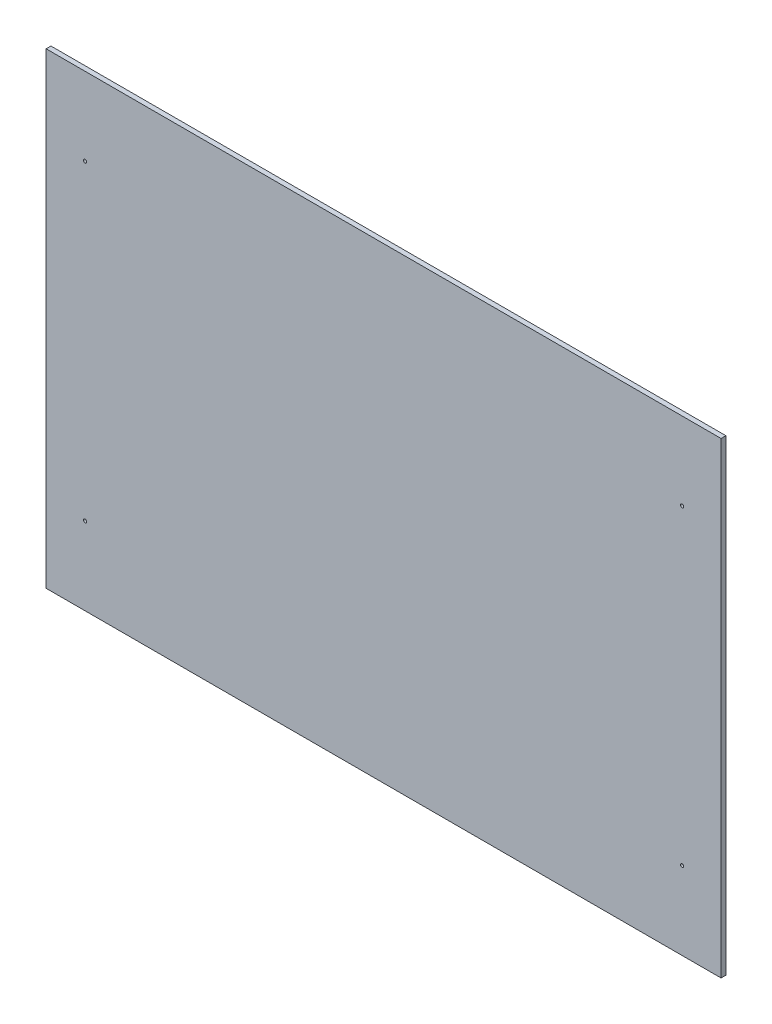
from build123d import *

# Parameters (mm, degrees)
SKETCH1_W                      = 330.2
SKETCH1_H                      = 228.6
BOSS_EXTRUDE1_DEPTH            = 2.3622
F_1_16_0_0625_DIAMETER_HOLE1_D = 1.5875


with BuildPart() as part:
    # Sketch1 → Boss-Extrude1 (new body)
    with BuildSketch(Plane.XY):
        with Locations((165.1, 114.3)):
            Rectangle(SKETCH1_W, SKETCH1_H)
    extrude(amount=BOSS_EXTRUDE1_DEPTH)

    # 1_16 _0.0625_ Diameter Hole1 (through all)
    with Locations(Plane.XY.offset(2.3622)):
        with Locations((19.05, 190.5), (311.15, 190.5), (19.05, 38.1), (311.15, 38.1)):
            Hole(F_1_16_0_0625_DIAMETER_HOLE1_D / 2)


solid = part.part
